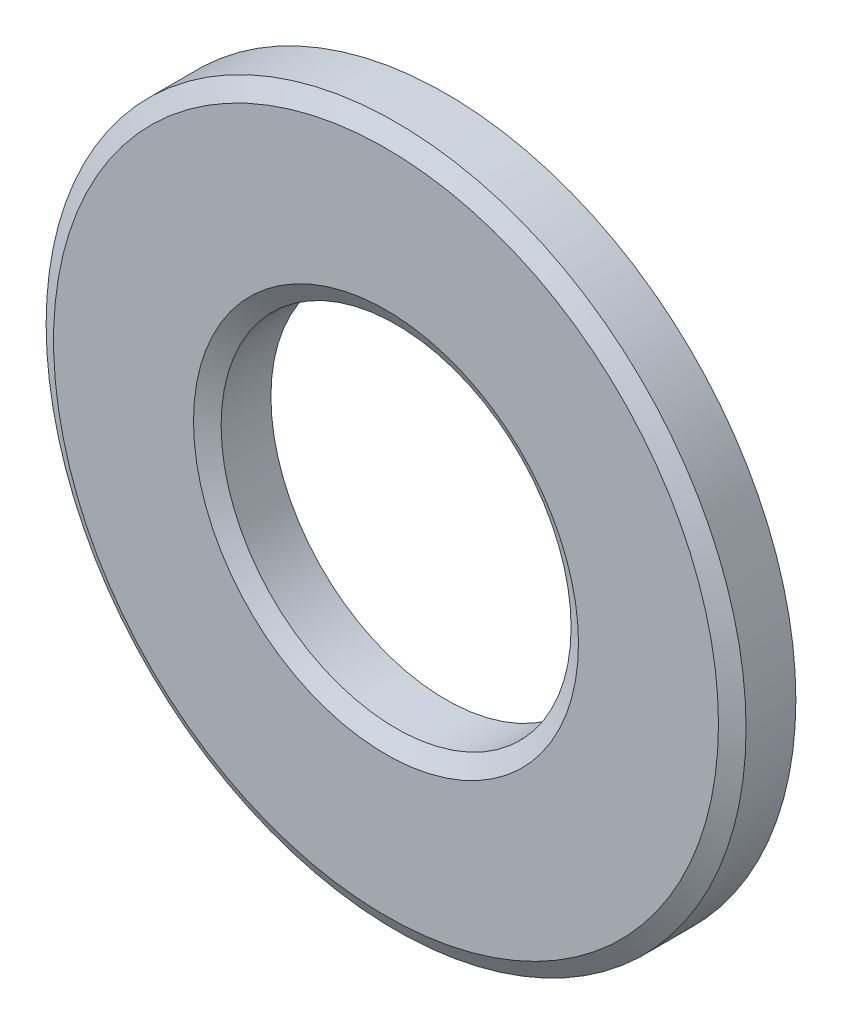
ISO-10303-21;
HEADER;
FILE_DESCRIPTION(('STEP AP214'),'2;1');
FILE_NAME('part.step','',(''),(''),'','','');
FILE_SCHEMA(('AUTOMOTIVE_DESIGN { 1 0 10303 214 1 1 1 1 }'));
ENDSEC;
DATA;
#1=APPLICATION_CONTEXT('core data for automotive mechanical design processes');
#2=APPLICATION_PROTOCOL_DEFINITION('international standard','automotive_design',2000,#1);
#3=PRODUCT_CONTEXT('',#1,'mechanical');
#4=PRODUCT('Part','Part','',(#3));
#5=PRODUCT_RELATED_PRODUCT_CATEGORY('part','',(#4));
#6=PRODUCT_DEFINITION_FORMATION('','',#4);
#7=PRODUCT_DEFINITION_CONTEXT('part definition',#1,'design');
#8=PRODUCT_DEFINITION('design','',#6,#7);
#9=PRODUCT_DEFINITION_SHAPE('','',#8);
#10=(LENGTH_UNIT() NAMED_UNIT(*) SI_UNIT(.MILLI.,.METRE.));
#11=(NAMED_UNIT(*) PLANE_ANGLE_UNIT() SI_UNIT($,.RADIAN.));
#12=(NAMED_UNIT(*) SI_UNIT($,.STERADIAN.) SOLID_ANGLE_UNIT());
#13=UNCERTAINTY_MEASURE_WITH_UNIT(LENGTH_MEASURE(1.E-05),#10,'distance_accuracy_value','');
#14=(GEOMETRIC_REPRESENTATION_CONTEXT(3) GLOBAL_UNCERTAINTY_ASSIGNED_CONTEXT((#13)) GLOBAL_UNIT_ASSIGNED_CONTEXT((#10,
#11,#12)) REPRESENTATION_CONTEXT('',''));
#15=CARTESIAN_POINT('',(0.,0.,0.));
#16=DIRECTION('',(0.,0.,1.));
#17=DIRECTION('',(1.,0.,0.));
#18=AXIS2_PLACEMENT_3D('',#15,#16,#17);
#19=CARTESIAN_POINT('',(0.,0.,1.2));
#20=DIRECTION('',(0.,0.,1.));
#21=DIRECTION('',(1.,0.,0.));
#22=AXIS2_PLACEMENT_3D('',#19,#20,#21);
#23=PLANE('',#22);
#24=CARTESIAN_POINT('',(0.,0.,1.2));
#25=DIRECTION('',(0.,0.,1.));
#26=DIRECTION('',(1.,0.,0.));
#27=AXIS2_PLACEMENT_3D('',#24,#25,#26);
#28=CIRCLE('',#27,3.3);
#29=CARTESIAN_POINT('',(3.3,0.,1.2));
#30=VERTEX_POINT('',#29);
#31=EDGE_CURVE('E53',#30,#30,#28,.F.);
#32=ORIENTED_EDGE('',*,*,#31,.T.);
#33=EDGE_LOOP('',(#32));
#34=FACE_BOUND('',#33,.T.);
#35=CARTESIAN_POINT('',(0.,0.,1.2));
#36=DIRECTION('',(0.,0.,1.));
#37=DIRECTION('',(1.,0.,0.));
#38=AXIS2_PLACEMENT_3D('',#35,#36,#37);
#39=CIRCLE('',#38,5.7);
#40=CARTESIAN_POINT('',(5.7,0.,1.2));
#41=VERTEX_POINT('',#40);
#42=EDGE_CURVE('E56',#41,#41,#39,.T.);
#43=ORIENTED_EDGE('',*,*,#42,.T.);
#44=EDGE_LOOP('',(#43));
#45=FACE_BOUND('',#44,.T.);
#46=ADVANCED_FACE('F33',(#34,#45),#23,.T.);
#47=CARTESIAN_POINT('',(0.,0.,0.));
#48=DIRECTION('',(0.,0.,1.));
#49=DIRECTION('',(1.,0.,0.));
#50=AXIS2_PLACEMENT_3D('',#47,#48,#49);
#51=PLANE('',#50);
#52=CARTESIAN_POINT('',(0.,0.,0.));
#53=DIRECTION('',(0.,0.,1.));
#54=DIRECTION('',(1.,0.,0.));
#55=AXIS2_PLACEMENT_3D('',#52,#53,#54);
#56=CIRCLE('',#55,3.3);
#57=CARTESIAN_POINT('',(3.3,0.,0.));
#58=VERTEX_POINT('',#57);
#59=EDGE_CURVE('E44',#58,#58,#56,.T.);
#60=ORIENTED_EDGE('',*,*,#59,.T.);
#61=EDGE_LOOP('',(#60));
#62=FACE_BOUND('',#61,.T.);
#63=CARTESIAN_POINT('',(0.,0.,0.));
#64=DIRECTION('',(0.,0.,1.));
#65=DIRECTION('',(1.,0.,0.));
#66=AXIS2_PLACEMENT_3D('',#63,#64,#65);
#67=CIRCLE('',#66,5.7);
#68=CARTESIAN_POINT('',(5.7,0.,0.));
#69=VERTEX_POINT('',#68);
#70=EDGE_CURVE('E48',#69,#69,#67,.F.);
#71=ORIENTED_EDGE('',*,*,#70,.T.);
#72=EDGE_LOOP('',(#71));
#73=FACE_BOUND('',#72,.T.);
#74=ADVANCED_FACE('F76',(#62,#73),#51,.F.);
#75=CARTESIAN_POINT('',(0.,0.,1.2));
#76=DIRECTION('',(0.,0.,-1.));
#77=DIRECTION('',(-1.,0.,0.));
#78=AXIS2_PLACEMENT_3D('',#75,#76,#77);
#79=CYLINDRICAL_SURFACE('',#78,6.);
#80=CARTESIAN_POINT('',(0.,0.,1.02679491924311));
#81=DIRECTION('',(0.,0.,1.));
#82=DIRECTION('',(1.,0.,0.));
#83=AXIS2_PLACEMENT_3D('',#80,#81,#82);
#84=CIRCLE('',#83,6.);
#85=CARTESIAN_POINT('',(6.,0.,1.02679491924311));
#86=VERTEX_POINT('',#85);
#87=EDGE_CURVE('E10',#86,#86,#84,.F.);
#88=ORIENTED_EDGE('',*,*,#87,.T.);
#89=EDGE_LOOP('',(#88));
#90=FACE_BOUND('',#89,.T.);
#91=CARTESIAN_POINT('',(0.,0.,0.173205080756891));
#92=DIRECTION('',(0.,0.,1.));
#93=DIRECTION('',(1.,0.,0.));
#94=AXIS2_PLACEMENT_3D('',#91,#92,#93);
#95=CIRCLE('',#94,6.);
#96=CARTESIAN_POINT('',(6.,0.,0.173205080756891));
#97=VERTEX_POINT('',#96);
#98=EDGE_CURVE('E40',#97,#97,#95,.T.);
#99=ORIENTED_EDGE('',*,*,#98,.T.);
#100=EDGE_LOOP('',(#99));
#101=FACE_BOUND('',#100,.T.);
#102=ADVANCED_FACE('F79',(#90,#101),#79,.T.);
#103=CARTESIAN_POINT('',(0.,0.,1.2));
#104=DIRECTION('',(0.,0.,-1.));
#105=DIRECTION('',(-1.,0.,0.));
#106=AXIS2_PLACEMENT_3D('',#103,#104,#105);
#107=CYLINDRICAL_SURFACE('',#106,3.);
#108=CARTESIAN_POINT('',(0.,0.,1.02679491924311));
#109=DIRECTION('',(0.,0.,1.));
#110=DIRECTION('',(1.,0.,0.));
#111=AXIS2_PLACEMENT_3D('',#108,#109,#110);
#112=CIRCLE('',#111,3.);
#113=CARTESIAN_POINT('',(3.,0.,1.02679491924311));
#114=VERTEX_POINT('',#113);
#115=EDGE_CURVE('E59',#114,#114,#112,.T.);
#116=ORIENTED_EDGE('',*,*,#115,.T.);
#117=EDGE_LOOP('',(#116));
#118=FACE_BOUND('',#117,.T.);
#119=CARTESIAN_POINT('',(0.,0.,0.173205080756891));
#120=DIRECTION('',(0.,0.,1.));
#121=DIRECTION('',(1.,0.,0.));
#122=AXIS2_PLACEMENT_3D('',#119,#120,#121);
#123=CIRCLE('',#122,3.);
#124=CARTESIAN_POINT('',(3.,0.,0.173205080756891));
#125=VERTEX_POINT('',#124);
#126=EDGE_CURVE('E62',#125,#125,#123,.F.);
#127=ORIENTED_EDGE('',*,*,#126,.T.);
#128=EDGE_LOOP('',(#127));
#129=FACE_BOUND('',#128,.T.);
#130=ADVANCED_FACE('F66',(#118,#129),#107,.F.);
#131=CARTESIAN_POINT('',(0.,0.,1.02679491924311));
#132=DIRECTION('',(0.,0.,1.));
#133=DIRECTION('',(1.,0.,0.));
#134=AXIS2_PLACEMENT_3D('',#131,#132,#133);
#135=CONICAL_SURFACE('',#134,3.,1.04719755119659);
#136=ORIENTED_EDGE('',*,*,#31,.F.);
#137=EDGE_LOOP('',(#136));
#138=FACE_BOUND('',#137,.T.);
#139=ORIENTED_EDGE('',*,*,#115,.F.);
#140=EDGE_LOOP('',(#139));
#141=FACE_BOUND('',#140,.T.);
#142=ADVANCED_FACE('F72',(#138,#141),#135,.F.);
#143=CARTESIAN_POINT('',(0.,0.,0.));
#144=DIRECTION('',(0.,0.,-1.));
#145=DIRECTION('',(-1.,0.,0.));
#146=AXIS2_PLACEMENT_3D('',#143,#144,#145);
#147=CONICAL_SURFACE('',#146,3.3,1.04719755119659);
#148=ORIENTED_EDGE('',*,*,#126,.F.);
#149=EDGE_LOOP('',(#148));
#150=FACE_BOUND('',#149,.T.);
#151=ORIENTED_EDGE('',*,*,#59,.F.);
#152=EDGE_LOOP('',(#151));
#153=FACE_BOUND('',#152,.T.);
#154=ADVANCED_FACE('F68',(#150,#153),#147,.F.);
#155=CARTESIAN_POINT('',(0.,0.,1.2));
#156=DIRECTION('',(0.,0.,-1.));
#157=DIRECTION('',(-1.,0.,0.));
#158=AXIS2_PLACEMENT_3D('',#155,#156,#157);
#159=CONICAL_SURFACE('',#158,5.7,1.04719755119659);
#160=ORIENTED_EDGE('',*,*,#87,.F.);
#161=EDGE_LOOP('',(#160));
#162=FACE_BOUND('',#161,.T.);
#163=ORIENTED_EDGE('',*,*,#42,.F.);
#164=EDGE_LOOP('',(#163));
#165=FACE_BOUND('',#164,.T.);
#166=ADVANCED_FACE('F71',(#162,#165),#159,.T.);
#167=CARTESIAN_POINT('',(0.,0.,0.173205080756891));
#168=DIRECTION('',(0.,0.,1.));
#169=DIRECTION('',(1.,0.,0.));
#170=AXIS2_PLACEMENT_3D('',#167,#168,#169);
#171=CONICAL_SURFACE('',#170,6.,1.04719755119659);
#172=ORIENTED_EDGE('',*,*,#70,.F.);
#173=EDGE_LOOP('',(#172));
#174=FACE_BOUND('',#173,.T.);
#175=ORIENTED_EDGE('',*,*,#98,.F.);
#176=EDGE_LOOP('',(#175));
#177=FACE_BOUND('',#176,.T.);
#178=ADVANCED_FACE('F35',(#174,#177),#171,.T.);
#179=CLOSED_SHELL('',(#46,#74,#102,#130,#142,#154,#166,#178));
#180=MANIFOLD_SOLID_BREP('B2',#179);
#181=ADVANCED_BREP_SHAPE_REPRESENTATION('',(#18,#180),#14);
#182=SHAPE_DEFINITION_REPRESENTATION(#9,#181);
ENDSEC;
END-ISO-10303-21;
